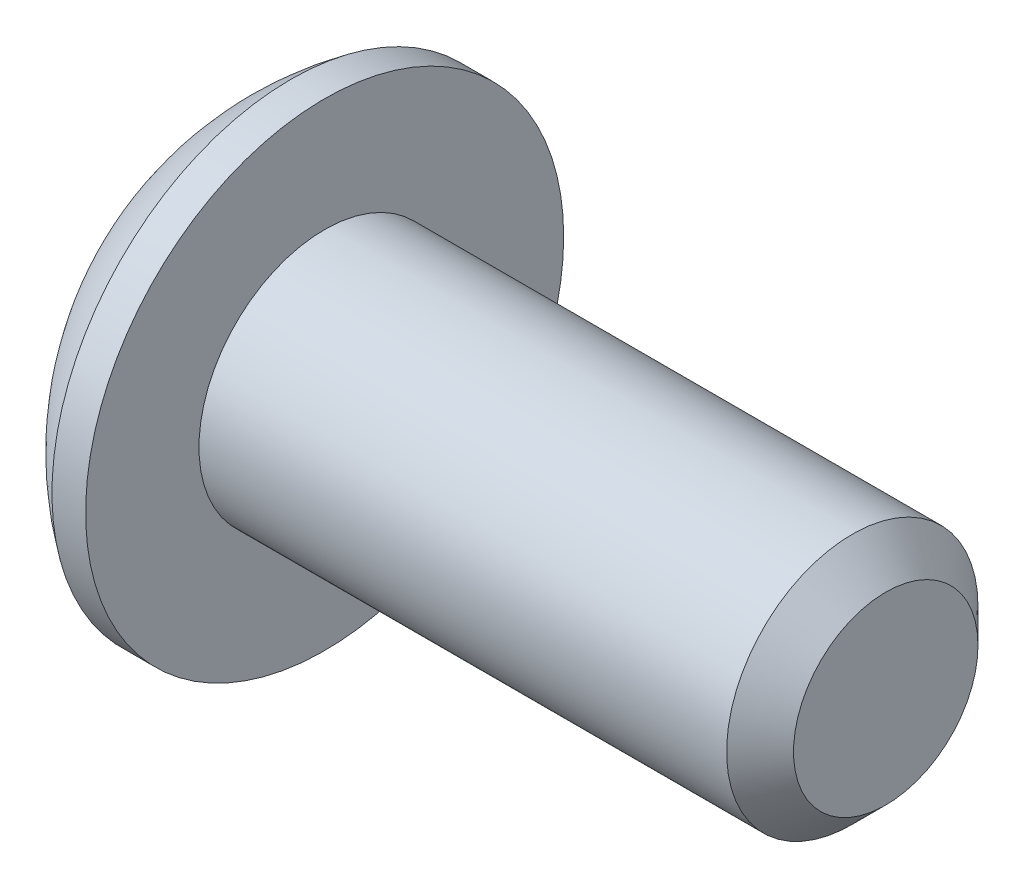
from build123d import *

# Parameters (mm, degrees)
EXTRUDE1_DEPTH = 0.889


with BuildPart() as part:
    # Sketch1 → Revolve1 (revolve)
    with BuildSketch(Plane.XY, mode=Mode.PRIVATE) as revolve1_sk:
        with BuildLine():
            Line((7.8486, 0), (7.8486, 1.04394))
            Line((7.8486, 1.04394), (7.47014, 1.4224))
            Line((7.47014, 1.4224), (1.4986, 1.4224))
            Line((1.4986, 1.4224), (1.4986, 2.7051))
            Line((1.4986, 2.7051), (1.1176, 2.7051))
            ThreePointArc((1.1176, 2.7051), (0.467369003, 2.104373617), (0, 1.35255))
            Line((0, 1.35255), (0, 0))
            Line((0, 0), (7.8486, 0))
        make_face()
    revolve(revolve1_sk.sketch.rotate(Axis((7.8486, 0, 0), (-1, 0, 0)), 90), axis=Axis((7.8486, 0, 0), (-1, 0, 0)))

    # Sketch2 → Extrude1 (cut)
    with BuildSketch(Plane.ZY):
        Polygon((0.7874, -0.454605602), (0.7874, 0.454605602), (0, 0.909211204), (-0.7874, 0.454605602), (-0.7874, -0.454605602), (0, -0.909211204), align=None)
    extrude(amount=-EXTRUDE1_DEPTH, mode=Mode.SUBTRACT)


solid = part.part
